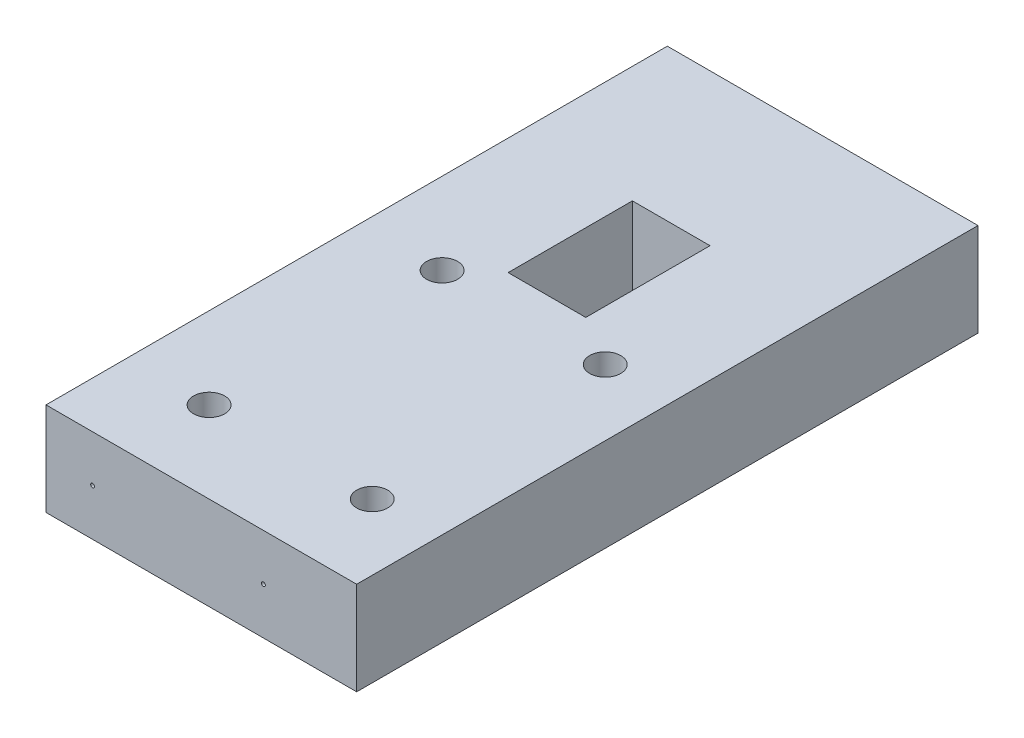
ISO-10303-21;
HEADER;
FILE_DESCRIPTION(('STEP AP214'),'2;1');
FILE_NAME('part.step','',(''),(''),'','','');
FILE_SCHEMA(('AUTOMOTIVE_DESIGN { 1 0 10303 214 1 1 1 1 }'));
ENDSEC;
DATA;
#1=APPLICATION_CONTEXT('core data for automotive mechanical design processes');
#2=APPLICATION_PROTOCOL_DEFINITION('international standard','automotive_design',2000,#1);
#3=PRODUCT_CONTEXT('',#1,'mechanical');
#4=PRODUCT('Part','Part','',(#3));
#5=PRODUCT_RELATED_PRODUCT_CATEGORY('part','',(#4));
#6=PRODUCT_DEFINITION_FORMATION('','',#4);
#7=PRODUCT_DEFINITION_CONTEXT('part definition',#1,'design');
#8=PRODUCT_DEFINITION('design','',#6,#7);
#9=PRODUCT_DEFINITION_SHAPE('','',#8);
#10=(LENGTH_UNIT() NAMED_UNIT(*) SI_UNIT(.MILLI.,.METRE.));
#11=(NAMED_UNIT(*) PLANE_ANGLE_UNIT() SI_UNIT($,.RADIAN.));
#12=(NAMED_UNIT(*) SI_UNIT($,.STERADIAN.) SOLID_ANGLE_UNIT());
#13=UNCERTAINTY_MEASURE_WITH_UNIT(LENGTH_MEASURE(1.E-05),#10,'distance_accuracy_value','');
#14=(GEOMETRIC_REPRESENTATION_CONTEXT(3) GLOBAL_UNCERTAINTY_ASSIGNED_CONTEXT((#13)) GLOBAL_UNIT_ASSIGNED_CONTEXT((#10,
#11,#12)) REPRESENTATION_CONTEXT('',''));
#15=CARTESIAN_POINT('',(0.,0.,0.));
#16=DIRECTION('',(0.,0.,1.));
#17=DIRECTION('',(1.,0.,0.));
#18=AXIS2_PLACEMENT_3D('',#15,#16,#17);
#19=CARTESIAN_POINT('',(0.,38.1,0.));
#20=DIRECTION('',(0.,1.,0.));
#21=DIRECTION('',(0.,0.,1.));
#22=AXIS2_PLACEMENT_3D('',#19,#20,#21);
#23=PLANE('',#22);
#24=CARTESIAN_POINT('',(-30.1625,38.1,-1.58750000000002));
#25=DIRECTION('',(0.,1.,0.));
#26=DIRECTION('',(0.,0.,1.));
#27=AXIS2_PLACEMENT_3D('',#24,#25,#26);
#28=CIRCLE('',#27,6.34999999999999);
#29=CARTESIAN_POINT('',(-30.1625,38.1,4.76249999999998));
#30=VERTEX_POINT('',#29);
#31=EDGE_CURVE('E145',#30,#30,#28,.T.);
#32=ORIENTED_EDGE('',*,*,#31,.F.);
#33=EDGE_LOOP('',(#32));
#34=FACE_BOUND('',#33,.T.);
#35=CARTESIAN_POINT('',(-30.1625,38.1,93.6625));
#36=DIRECTION('',(0.,1.,0.));
#37=DIRECTION('',(0.,0.,1.));
#38=AXIS2_PLACEMENT_3D('',#35,#36,#37);
#39=CIRCLE('',#38,6.34999999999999);
#40=CARTESIAN_POINT('',(-30.1625,38.1,100.0125));
#41=VERTEX_POINT('',#40);
#42=EDGE_CURVE('E151',#41,#41,#39,.T.);
#43=ORIENTED_EDGE('',*,*,#42,.F.);
#44=EDGE_LOOP('',(#43));
#45=FACE_BOUND('',#44,.T.);
#46=CARTESIAN_POINT('',(36.5125,38.1,-1.58750000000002));
#47=DIRECTION('',(0.,1.,0.));
#48=DIRECTION('',(0.,0.,1.));
#49=AXIS2_PLACEMENT_3D('',#46,#47,#48);
#50=CIRCLE('',#49,6.34999999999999);
#51=CARTESIAN_POINT('',(36.5125,38.1,4.76249999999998));
#52=VERTEX_POINT('',#51);
#53=EDGE_CURVE('E157',#52,#52,#50,.T.);
#54=ORIENTED_EDGE('',*,*,#53,.F.);
#55=EDGE_LOOP('',(#54));
#56=FACE_BOUND('',#55,.T.);
#57=CARTESIAN_POINT('',(36.5125,38.1,93.6625));
#58=DIRECTION('',(0.,1.,0.));
#59=DIRECTION('',(0.,0.,1.));
#60=AXIS2_PLACEMENT_3D('',#57,#58,#59);
#61=CIRCLE('',#60,6.34999999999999);
#62=CARTESIAN_POINT('',(36.5125,38.1,100.0125));
#63=VERTEX_POINT('',#62);
#64=EDGE_CURVE('E163',#63,#63,#61,.T.);
#65=ORIENTED_EDGE('',*,*,#64,.F.);
#66=EDGE_LOOP('',(#65));
#67=FACE_BOUND('',#66,.T.);
#68=DIRECTION('',(0.,0.,-1.));
#69=VECTOR('',#68,1.);
#70=CARTESIAN_POINT('',(63.5,38.1,-127.));
#71=LINE('',#70,#69);
#72=CARTESIAN_POINT('',(63.5,38.1,127.));
#73=VERTEX_POINT('',#72);
#74=CARTESIAN_POINT('',(63.5,38.1,-127.));
#75=VERTEX_POINT('',#74);
#76=EDGE_CURVE('E195',#73,#75,#71,.T.);
#77=ORIENTED_EDGE('',*,*,#76,.T.);
#78=DIRECTION('',(-1.,0.,0.));
#79=VECTOR('',#78,1.);
#80=CARTESIAN_POINT('',(-63.5,38.1,-127.));
#81=LINE('',#80,#79);
#82=CARTESIAN_POINT('',(-63.5,38.1,-127.));
#83=VERTEX_POINT('',#82);
#84=EDGE_CURVE('E198',#75,#83,#81,.T.);
#85=ORIENTED_EDGE('',*,*,#84,.T.);
#86=DIRECTION('',(0.,0.,1.));
#87=VECTOR('',#86,1.);
#88=CARTESIAN_POINT('',(-63.5,38.1,-127.));
#89=LINE('',#88,#87);
#90=CARTESIAN_POINT('',(-63.5,38.1,127.));
#91=VERTEX_POINT('',#90);
#92=EDGE_CURVE('E201',#83,#91,#89,.T.);
#93=ORIENTED_EDGE('',*,*,#92,.T.);
#94=DIRECTION('',(1.,0.,0.));
#95=VECTOR('',#94,1.);
#96=CARTESIAN_POINT('',(-63.5,38.1,127.));
#97=LINE('',#96,#95);
#98=EDGE_CURVE('E203',#91,#73,#97,.T.);
#99=ORIENTED_EDGE('',*,*,#98,.T.);
#100=EDGE_LOOP('',(#77,#85,#93,#99));
#101=FACE_BOUND('',#100,.T.);
#102=DIRECTION('',(1.,0.,0.));
#103=VECTOR('',#102,1.);
#104=CARTESIAN_POINT('',(-15.8750000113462,38.1,-14.2874896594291));
#105=LINE('',#104,#103);
#106=CARTESIAN_POINT('',(-15.8750000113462,38.1,-14.2874896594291));
#107=VERTEX_POINT('',#106);
#108=CARTESIAN_POINT('',(15.8749999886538,38.1,-14.2874896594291));
#109=VERTEX_POINT('',#108);
#110=EDGE_CURVE('E171',#107,#109,#105,.T.);
#111=ORIENTED_EDGE('',*,*,#110,.F.);
#112=DIRECTION('',(0.,0.,1.));
#113=VECTOR('',#112,1.);
#114=CARTESIAN_POINT('',(-15.8750000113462,38.1,-65.0874896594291));
#115=LINE('',#114,#113);
#116=CARTESIAN_POINT('',(-15.8750000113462,38.1,-65.0874896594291));
#117=VERTEX_POINT('',#116);
#118=EDGE_CURVE('E169',#117,#107,#115,.T.);
#119=ORIENTED_EDGE('',*,*,#118,.F.);
#120=DIRECTION('',(-1.,0.,0.));
#121=VECTOR('',#120,1.);
#122=CARTESIAN_POINT('',(-15.8750000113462,38.1,-65.0874896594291));
#123=LINE('',#122,#121);
#124=CARTESIAN_POINT('',(15.8749999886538,38.1,-65.0874896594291));
#125=VERTEX_POINT('',#124);
#126=EDGE_CURVE('E176',#125,#117,#123,.T.);
#127=ORIENTED_EDGE('',*,*,#126,.F.);
#128=DIRECTION('',(0.,0.,-1.));
#129=VECTOR('',#128,1.);
#130=CARTESIAN_POINT('',(15.8749999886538,38.1,-65.0874896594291));
#131=LINE('',#130,#129);
#132=EDGE_CURVE('E174',#109,#125,#131,.T.);
#133=ORIENTED_EDGE('',*,*,#132,.F.);
#134=EDGE_LOOP('',(#111,#119,#127,#133));
#135=FACE_BOUND('',#134,.T.);
#136=ADVANCED_FACE('F35',(#34,#45,#56,#67,#101,#135),#23,.T.);
#137=CARTESIAN_POINT('',(0.,0.,0.));
#138=DIRECTION('',(0.,1.,0.));
#139=DIRECTION('',(0.,0.,1.));
#140=AXIS2_PLACEMENT_3D('',#137,#138,#139);
#141=PLANE('',#140);
#142=CARTESIAN_POINT('',(-30.1625,0.,-1.58750000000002));
#143=DIRECTION('',(0.,1.,0.));
#144=DIRECTION('',(0.,0.,1.));
#145=AXIS2_PLACEMENT_3D('',#142,#143,#144);
#146=CIRCLE('',#145,6.34999999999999);
#147=CARTESIAN_POINT('',(-30.1625,0.,4.76249999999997));
#148=VERTEX_POINT('',#147);
#149=EDGE_CURVE('E148',#148,#148,#146,.T.);
#150=ORIENTED_EDGE('',*,*,#149,.T.);
#151=EDGE_LOOP('',(#150));
#152=FACE_BOUND('',#151,.T.);
#153=CARTESIAN_POINT('',(-30.1625,0.,93.6625));
#154=DIRECTION('',(0.,1.,0.));
#155=DIRECTION('',(0.,0.,1.));
#156=AXIS2_PLACEMENT_3D('',#153,#154,#155);
#157=CIRCLE('',#156,6.34999999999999);
#158=CARTESIAN_POINT('',(-30.1625,0.,100.0125));
#159=VERTEX_POINT('',#158);
#160=EDGE_CURVE('E154',#159,#159,#157,.T.);
#161=ORIENTED_EDGE('',*,*,#160,.T.);
#162=EDGE_LOOP('',(#161));
#163=FACE_BOUND('',#162,.T.);
#164=CARTESIAN_POINT('',(36.5125,0.,-1.58750000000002));
#165=DIRECTION('',(0.,1.,0.));
#166=DIRECTION('',(0.,0.,1.));
#167=AXIS2_PLACEMENT_3D('',#164,#165,#166);
#168=CIRCLE('',#167,6.34999999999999);
#169=CARTESIAN_POINT('',(36.5125,0.,4.76249999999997));
#170=VERTEX_POINT('',#169);
#171=EDGE_CURVE('E160',#170,#170,#168,.T.);
#172=ORIENTED_EDGE('',*,*,#171,.T.);
#173=EDGE_LOOP('',(#172));
#174=FACE_BOUND('',#173,.T.);
#175=CARTESIAN_POINT('',(36.5125,0.,93.6625));
#176=DIRECTION('',(0.,1.,0.));
#177=DIRECTION('',(0.,0.,1.));
#178=AXIS2_PLACEMENT_3D('',#175,#176,#177);
#179=CIRCLE('',#178,6.34999999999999);
#180=CARTESIAN_POINT('',(36.5125,0.,100.0125));
#181=VERTEX_POINT('',#180);
#182=EDGE_CURVE('E166',#181,#181,#179,.T.);
#183=ORIENTED_EDGE('',*,*,#182,.T.);
#184=EDGE_LOOP('',(#183));
#185=FACE_BOUND('',#184,.T.);
#186=DIRECTION('',(0.,0.,-1.));
#187=VECTOR('',#186,1.);
#188=CARTESIAN_POINT('',(63.5,0.,-127.));
#189=LINE('',#188,#187);
#190=CARTESIAN_POINT('',(63.5,0.,127.));
#191=VERTEX_POINT('',#190);
#192=CARTESIAN_POINT('',(63.5,0.,-127.));
#193=VERTEX_POINT('',#192);
#194=EDGE_CURVE('E194',#191,#193,#189,.T.);
#195=ORIENTED_EDGE('',*,*,#194,.F.);
#196=DIRECTION('',(1.,0.,0.));
#197=VECTOR('',#196,1.);
#198=CARTESIAN_POINT('',(-63.5,0.,127.));
#199=LINE('',#198,#197);
#200=CARTESIAN_POINT('',(-63.5,0.,127.));
#201=VERTEX_POINT('',#200);
#202=EDGE_CURVE('E199',#201,#191,#199,.T.);
#203=ORIENTED_EDGE('',*,*,#202,.F.);
#204=DIRECTION('',(0.,0.,1.));
#205=VECTOR('',#204,1.);
#206=CARTESIAN_POINT('',(-63.5,0.,-127.));
#207=LINE('',#206,#205);
#208=CARTESIAN_POINT('',(-63.5,0.,-127.));
#209=VERTEX_POINT('',#208);
#210=EDGE_CURVE('E210',#209,#201,#207,.T.);
#211=ORIENTED_EDGE('',*,*,#210,.F.);
#212=DIRECTION('',(-1.,0.,0.));
#213=VECTOR('',#212,1.);
#214=CARTESIAN_POINT('',(-63.5,0.,-127.));
#215=LINE('',#214,#213);
#216=EDGE_CURVE('E208',#193,#209,#215,.T.);
#217=ORIENTED_EDGE('',*,*,#216,.F.);
#218=EDGE_LOOP('',(#195,#203,#211,#217));
#219=FACE_BOUND('',#218,.T.);
#220=DIRECTION('',(0.,0.,1.));
#221=VECTOR('',#220,1.);
#222=CARTESIAN_POINT('',(-15.8750000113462,0.,-65.0874896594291));
#223=LINE('',#222,#221);
#224=CARTESIAN_POINT('',(-15.8750000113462,0.,-65.0874896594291));
#225=VERTEX_POINT('',#224);
#226=CARTESIAN_POINT('',(-15.8750000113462,0.,-14.2874896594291));
#227=VERTEX_POINT('',#226);
#228=EDGE_CURVE('E58',#225,#227,#223,.T.);
#229=ORIENTED_EDGE('',*,*,#228,.T.);
#230=DIRECTION('',(1.,0.,0.));
#231=VECTOR('',#230,1.);
#232=CARTESIAN_POINT('',(-15.8750000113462,0.,-14.2874896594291));
#233=LINE('',#232,#231);
#234=CARTESIAN_POINT('',(15.8749999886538,0.,-14.2874896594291));
#235=VERTEX_POINT('',#234);
#236=EDGE_CURVE('E180',#227,#235,#233,.T.);
#237=ORIENTED_EDGE('',*,*,#236,.T.);
#238=DIRECTION('',(0.,0.,-1.));
#239=VECTOR('',#238,1.);
#240=CARTESIAN_POINT('',(15.8749999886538,0.,-65.0874896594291));
#241=LINE('',#240,#239);
#242=CARTESIAN_POINT('',(15.8749999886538,0.,-65.0874896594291));
#243=VERTEX_POINT('',#242);
#244=EDGE_CURVE('E183',#235,#243,#241,.T.);
#245=ORIENTED_EDGE('',*,*,#244,.T.);
#246=DIRECTION('',(-1.,0.,0.));
#247=VECTOR('',#246,1.);
#248=CARTESIAN_POINT('',(-15.8750000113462,0.,-65.0874896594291));
#249=LINE('',#248,#247);
#250=EDGE_CURVE('E172',#243,#225,#249,.T.);
#251=ORIENTED_EDGE('',*,*,#250,.T.);
#252=EDGE_LOOP('',(#229,#237,#245,#251));
#253=FACE_BOUND('',#252,.T.);
#254=ADVANCED_FACE('F228',(#152,#163,#174,#185,#219,#253),#141,.F.);
#255=CARTESIAN_POINT('',(63.5,38.1,-127.));
#256=DIRECTION('',(-1.,0.,0.));
#257=DIRECTION('',(0.,0.,1.));
#258=AXIS2_PLACEMENT_3D('',#255,#256,#257);
#259=PLANE('',#258);
#260=ORIENTED_EDGE('',*,*,#194,.T.);
#261=DIRECTION('',(0.,-1.,0.));
#262=VECTOR('',#261,1.);
#263=CARTESIAN_POINT('',(63.5,38.1,-127.));
#264=LINE('',#263,#262);
#265=EDGE_CURVE('E11',#75,#193,#264,.T.);
#266=ORIENTED_EDGE('',*,*,#265,.F.);
#267=ORIENTED_EDGE('',*,*,#76,.F.);
#268=DIRECTION('',(0.,-1.,0.));
#269=VECTOR('',#268,1.);
#270=CARTESIAN_POINT('',(63.5,38.1,127.));
#271=LINE('',#270,#269);
#272=EDGE_CURVE('E205',#73,#191,#271,.T.);
#273=ORIENTED_EDGE('',*,*,#272,.T.);
#274=EDGE_LOOP('',(#260,#266,#267,#273));
#275=FACE_BOUND('',#274,.T.);
#276=ADVANCED_FACE('F37',(#275),#259,.F.);
#277=CARTESIAN_POINT('',(-63.5,38.1,-127.));
#278=DIRECTION('',(0.,0.,1.));
#279=DIRECTION('',(1.,0.,0.));
#280=AXIS2_PLACEMENT_3D('',#277,#278,#279);
#281=PLANE('',#280);
#282=CARTESIAN_POINT('',(25.4,19.05,-127.));
#283=DIRECTION('',(0.,0.,-1.));
#284=DIRECTION('',(-1.,0.,0.));
#285=AXIS2_PLACEMENT_3D('',#282,#283,#284);
#286=CIRCLE('',#285,0.793749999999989);
#287=CARTESIAN_POINT('',(24.60625,19.05,-127.));
#288=VERTEX_POINT('',#287);
#289=EDGE_CURVE('E123',#288,#288,#286,.T.);
#290=ORIENTED_EDGE('',*,*,#289,.F.);
#291=EDGE_LOOP('',(#290));
#292=FACE_BOUND('',#291,.T.);
#293=CARTESIAN_POINT('',(-44.45,19.05,-127.));
#294=DIRECTION('',(0.,0.,-1.));
#295=DIRECTION('',(-1.,0.,0.));
#296=AXIS2_PLACEMENT_3D('',#293,#294,#295);
#297=CIRCLE('',#296,0.793749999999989);
#298=CARTESIAN_POINT('',(-45.24375,19.05,-127.));
#299=VERTEX_POINT('',#298);
#300=EDGE_CURVE('E122',#299,#299,#297,.T.);
#301=ORIENTED_EDGE('',*,*,#300,.F.);
#302=EDGE_LOOP('',(#301));
#303=FACE_BOUND('',#302,.T.);
#304=ORIENTED_EDGE('',*,*,#216,.T.);
#305=DIRECTION('',(0.,-1.,0.));
#306=VECTOR('',#305,1.);
#307=CARTESIAN_POINT('',(-63.5,38.1,-127.));
#308=LINE('',#307,#306);
#309=EDGE_CURVE('E43',#83,#209,#308,.T.);
#310=ORIENTED_EDGE('',*,*,#309,.F.);
#311=ORIENTED_EDGE('',*,*,#84,.F.);
#312=ORIENTED_EDGE('',*,*,#265,.T.);
#313=EDGE_LOOP('',(#304,#310,#311,#312));
#314=FACE_BOUND('',#313,.T.);
#315=ADVANCED_FACE('F239',(#292,#303,#314),#281,.F.);
#316=CARTESIAN_POINT('',(-63.5,38.1,-127.));
#317=DIRECTION('',(1.,0.,0.));
#318=DIRECTION('',(0.,0.,-1.));
#319=AXIS2_PLACEMENT_3D('',#316,#317,#318);
#320=PLANE('',#319);
#321=ORIENTED_EDGE('',*,*,#210,.T.);
#322=DIRECTION('',(0.,-1.,0.));
#323=VECTOR('',#322,1.);
#324=CARTESIAN_POINT('',(-63.5,38.1,127.));
#325=LINE('',#324,#323);
#326=EDGE_CURVE('E215',#91,#201,#325,.T.);
#327=ORIENTED_EDGE('',*,*,#326,.F.);
#328=ORIENTED_EDGE('',*,*,#92,.F.);
#329=ORIENTED_EDGE('',*,*,#309,.T.);
#330=EDGE_LOOP('',(#321,#327,#328,#329));
#331=FACE_BOUND('',#330,.T.);
#332=ADVANCED_FACE('F222',(#331),#320,.F.);
#333=CARTESIAN_POINT('',(-63.5,38.1,127.));
#334=DIRECTION('',(0.,0.,-1.));
#335=DIRECTION('',(-1.,0.,0.));
#336=AXIS2_PLACEMENT_3D('',#333,#334,#335);
#337=PLANE('',#336);
#338=CARTESIAN_POINT('',(-44.45,19.05,127.));
#339=DIRECTION('',(0.,0.,1.));
#340=DIRECTION('',(1.,0.,0.));
#341=AXIS2_PLACEMENT_3D('',#338,#339,#340);
#342=CIRCLE('',#341,0.793749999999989);
#343=CARTESIAN_POINT('',(-43.65625,19.05,127.));
#344=VERTEX_POINT('',#343);
#345=EDGE_CURVE('E133',#344,#344,#342,.T.);
#346=ORIENTED_EDGE('',*,*,#345,.F.);
#347=EDGE_LOOP('',(#346));
#348=FACE_BOUND('',#347,.T.);
#349=CARTESIAN_POINT('',(25.4,19.05,127.));
#350=DIRECTION('',(0.,0.,1.));
#351=DIRECTION('',(1.,0.,0.));
#352=AXIS2_PLACEMENT_3D('',#349,#350,#351);
#353=CIRCLE('',#352,0.793749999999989);
#354=CARTESIAN_POINT('',(26.19375,19.05,127.));
#355=VERTEX_POINT('',#354);
#356=EDGE_CURVE('E139',#355,#355,#353,.T.);
#357=ORIENTED_EDGE('',*,*,#356,.F.);
#358=EDGE_LOOP('',(#357));
#359=FACE_BOUND('',#358,.T.);
#360=ORIENTED_EDGE('',*,*,#202,.T.);
#361=ORIENTED_EDGE('',*,*,#272,.F.);
#362=ORIENTED_EDGE('',*,*,#98,.F.);
#363=ORIENTED_EDGE('',*,*,#326,.T.);
#364=EDGE_LOOP('',(#360,#361,#362,#363));
#365=FACE_BOUND('',#364,.T.);
#366=ADVANCED_FACE('F232',(#348,#359,#365),#337,.F.);
#367=CARTESIAN_POINT('',(-15.8750000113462,38.1,-65.0874896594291));
#368=DIRECTION('',(1.,0.,0.));
#369=DIRECTION('',(0.,0.,-1.));
#370=AXIS2_PLACEMENT_3D('',#367,#368,#369);
#371=PLANE('',#370);
#372=ORIENTED_EDGE('',*,*,#228,.F.);
#373=DIRECTION('',(0.,-1.,0.));
#374=VECTOR('',#373,1.);
#375=CARTESIAN_POINT('',(-15.8750000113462,38.1,-65.0874896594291));
#376=LINE('',#375,#374);
#377=EDGE_CURVE('E178',#117,#225,#376,.T.);
#378=ORIENTED_EDGE('',*,*,#377,.F.);
#379=ORIENTED_EDGE('',*,*,#118,.T.);
#380=DIRECTION('',(0.,-1.,0.));
#381=VECTOR('',#380,1.);
#382=CARTESIAN_POINT('',(-15.8750000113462,38.1,-14.2874896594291));
#383=LINE('',#382,#381);
#384=EDGE_CURVE('E192',#107,#227,#383,.T.);
#385=ORIENTED_EDGE('',*,*,#384,.T.);
#386=EDGE_LOOP('',(#372,#378,#379,#385));
#387=FACE_BOUND('',#386,.T.);
#388=ADVANCED_FACE('F260',(#387),#371,.T.);
#389=CARTESIAN_POINT('',(-15.8750000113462,38.1,-14.2874896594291));
#390=DIRECTION('',(0.,0.,-1.));
#391=DIRECTION('',(-1.,0.,0.));
#392=AXIS2_PLACEMENT_3D('',#389,#390,#391);
#393=PLANE('',#392);
#394=ORIENTED_EDGE('',*,*,#236,.F.);
#395=ORIENTED_EDGE('',*,*,#384,.F.);
#396=ORIENTED_EDGE('',*,*,#110,.T.);
#397=DIRECTION('',(0.,-1.,0.));
#398=VECTOR('',#397,1.);
#399=CARTESIAN_POINT('',(15.8749999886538,38.1,-14.2874896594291));
#400=LINE('',#399,#398);
#401=EDGE_CURVE('E190',#109,#235,#400,.T.);
#402=ORIENTED_EDGE('',*,*,#401,.T.);
#403=EDGE_LOOP('',(#394,#395,#396,#402));
#404=FACE_BOUND('',#403,.T.);
#405=ADVANCED_FACE('F268',(#404),#393,.T.);
#406=CARTESIAN_POINT('',(15.8749999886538,38.1,-65.0874896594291));
#407=DIRECTION('',(-1.,0.,0.));
#408=DIRECTION('',(0.,0.,1.));
#409=AXIS2_PLACEMENT_3D('',#406,#407,#408);
#410=PLANE('',#409);
#411=ORIENTED_EDGE('',*,*,#244,.F.);
#412=ORIENTED_EDGE('',*,*,#401,.F.);
#413=ORIENTED_EDGE('',*,*,#132,.T.);
#414=DIRECTION('',(0.,-1.,0.));
#415=VECTOR('',#414,1.);
#416=CARTESIAN_POINT('',(15.8749999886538,38.1,-65.0874896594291));
#417=LINE('',#416,#415);
#418=EDGE_CURVE('E50',#125,#243,#417,.T.);
#419=ORIENTED_EDGE('',*,*,#418,.T.);
#420=EDGE_LOOP('',(#411,#412,#413,#419));
#421=FACE_BOUND('',#420,.T.);
#422=ADVANCED_FACE('F310',(#421),#410,.T.);
#423=CARTESIAN_POINT('',(-15.8750000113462,38.1,-65.0874896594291));
#424=DIRECTION('',(0.,0.,1.));
#425=DIRECTION('',(1.,0.,0.));
#426=AXIS2_PLACEMENT_3D('',#423,#424,#425);
#427=PLANE('',#426);
#428=ORIENTED_EDGE('',*,*,#250,.F.);
#429=ORIENTED_EDGE('',*,*,#418,.F.);
#430=ORIENTED_EDGE('',*,*,#126,.T.);
#431=ORIENTED_EDGE('',*,*,#377,.T.);
#432=EDGE_LOOP('',(#428,#429,#430,#431));
#433=FACE_BOUND('',#432,.T.);
#434=ADVANCED_FACE('F306',(#433),#427,.T.);
#435=CARTESIAN_POINT('',(36.5125,38.1,93.6625));
#436=DIRECTION('',(0.,1.,0.));
#437=DIRECTION('',(0.,0.,1.));
#438=AXIS2_PLACEMENT_3D('',#435,#436,#437);
#439=CYLINDRICAL_SURFACE('',#438,6.34999999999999);
#440=ORIENTED_EDGE('',*,*,#182,.F.);
#441=EDGE_LOOP('',(#440));
#442=FACE_BOUND('',#441,.T.);
#443=ORIENTED_EDGE('',*,*,#64,.T.);
#444=EDGE_LOOP('',(#443));
#445=FACE_BOUND('',#444,.T.);
#446=ADVANCED_FACE('F302',(#442,#445),#439,.F.);
#447=CARTESIAN_POINT('',(36.5125,38.1,-1.58750000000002));
#448=DIRECTION('',(0.,1.,0.));
#449=DIRECTION('',(0.,0.,1.));
#450=AXIS2_PLACEMENT_3D('',#447,#448,#449);
#451=CYLINDRICAL_SURFACE('',#450,6.34999999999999);
#452=ORIENTED_EDGE('',*,*,#171,.F.);
#453=EDGE_LOOP('',(#452));
#454=FACE_BOUND('',#453,.T.);
#455=ORIENTED_EDGE('',*,*,#53,.T.);
#456=EDGE_LOOP('',(#455));
#457=FACE_BOUND('',#456,.T.);
#458=ADVANCED_FACE('F298',(#454,#457),#451,.F.);
#459=CARTESIAN_POINT('',(-30.1625,38.1,93.6625));
#460=DIRECTION('',(0.,1.,0.));
#461=DIRECTION('',(0.,0.,1.));
#462=AXIS2_PLACEMENT_3D('',#459,#460,#461);
#463=CYLINDRICAL_SURFACE('',#462,6.34999999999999);
#464=ORIENTED_EDGE('',*,*,#160,.F.);
#465=EDGE_LOOP('',(#464));
#466=FACE_BOUND('',#465,.T.);
#467=ORIENTED_EDGE('',*,*,#42,.T.);
#468=EDGE_LOOP('',(#467));
#469=FACE_BOUND('',#468,.T.);
#470=ADVANCED_FACE('F294',(#466,#469),#463,.F.);
#471=CARTESIAN_POINT('',(-30.1625,38.1,-1.58750000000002));
#472=DIRECTION('',(0.,1.,0.));
#473=DIRECTION('',(0.,0.,1.));
#474=AXIS2_PLACEMENT_3D('',#471,#472,#473);
#475=CYLINDRICAL_SURFACE('',#474,6.34999999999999);
#476=ORIENTED_EDGE('',*,*,#149,.F.);
#477=EDGE_LOOP('',(#476));
#478=FACE_BOUND('',#477,.T.);
#479=ORIENTED_EDGE('',*,*,#31,.T.);
#480=EDGE_LOOP('',(#479));
#481=FACE_BOUND('',#480,.T.);
#482=ADVANCED_FACE('F286',(#478,#481),#475,.F.);
#483=CARTESIAN_POINT('',(25.4,19.05,88.9));
#484=DIRECTION('',(0.,0.,1.));
#485=DIRECTION('',(1.,0.,0.));
#486=AXIS2_PLACEMENT_3D('',#483,#484,#485);
#487=CONICAL_SURFACE('',#486,0.793749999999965,1.02974425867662);
#488=CARTESIAN_POINT('',(25.4,19.05,88.4230668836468));
#489=VERTEX_POINT('',#488);
#490=VERTEX_LOOP('',#489);
#491=FACE_BOUND('',#490,.T.);
#492=CARTESIAN_POINT('',(25.4,19.05,88.9));
#493=DIRECTION('',(0.,0.,1.));
#494=DIRECTION('',(1.,0.,0.));
#495=AXIS2_PLACEMENT_3D('',#492,#493,#494);
#496=CIRCLE('',#495,0.793749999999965);
#497=CARTESIAN_POINT('',(26.19375,19.05,88.9));
#498=VERTEX_POINT('',#497);
#499=EDGE_CURVE('E142',#498,#498,#496,.T.);
#500=ORIENTED_EDGE('',*,*,#499,.T.);
#501=EDGE_LOOP('',(#500));
#502=FACE_BOUND('',#501,.T.);
#503=ADVANCED_FACE('F276',(#491,#502),#487,.F.);
#504=CARTESIAN_POINT('',(25.4,19.05,127.));
#505=DIRECTION('',(0.,0.,1.));
#506=DIRECTION('',(1.,0.,0.));
#507=AXIS2_PLACEMENT_3D('',#504,#505,#506);
#508=CYLINDRICAL_SURFACE('',#507,0.793749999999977);
#509=ORIENTED_EDGE('',*,*,#499,.F.);
#510=EDGE_LOOP('',(#509));
#511=FACE_BOUND('',#510,.T.);
#512=ORIENTED_EDGE('',*,*,#356,.T.);
#513=EDGE_LOOP('',(#512));
#514=FACE_BOUND('',#513,.T.);
#515=ADVANCED_FACE('F273',(#511,#514),#508,.F.);
#516=CARTESIAN_POINT('',(-44.45,19.05,88.9));
#517=DIRECTION('',(0.,0.,1.));
#518=DIRECTION('',(1.,0.,0.));
#519=AXIS2_PLACEMENT_3D('',#516,#517,#518);
#520=CONICAL_SURFACE('',#519,0.793749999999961,1.02974425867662);
#521=CARTESIAN_POINT('',(-44.45,19.05,88.4230668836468));
#522=VERTEX_POINT('',#521);
#523=VERTEX_LOOP('',#522);
#524=FACE_BOUND('',#523,.T.);
#525=CARTESIAN_POINT('',(-44.45,19.05,88.9));
#526=DIRECTION('',(0.,0.,1.));
#527=DIRECTION('',(1.,0.,0.));
#528=AXIS2_PLACEMENT_3D('',#525,#526,#527);
#529=CIRCLE('',#528,0.793749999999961);
#530=CARTESIAN_POINT('',(-43.65625,19.05,88.9));
#531=VERTEX_POINT('',#530);
#532=EDGE_CURVE('E136',#531,#531,#529,.T.);
#533=ORIENTED_EDGE('',*,*,#532,.T.);
#534=EDGE_LOOP('',(#533));
#535=FACE_BOUND('',#534,.T.);
#536=ADVANCED_FACE('F275',(#524,#535),#520,.F.);
#537=CARTESIAN_POINT('',(-44.45,19.05,127.));
#538=DIRECTION('',(0.,0.,1.));
#539=DIRECTION('',(1.,0.,0.));
#540=AXIS2_PLACEMENT_3D('',#537,#538,#539);
#541=CYLINDRICAL_SURFACE('',#540,0.793749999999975);
#542=ORIENTED_EDGE('',*,*,#532,.F.);
#543=EDGE_LOOP('',(#542));
#544=FACE_BOUND('',#543,.T.);
#545=ORIENTED_EDGE('',*,*,#345,.T.);
#546=EDGE_LOOP('',(#545));
#547=FACE_BOUND('',#546,.T.);
#548=ADVANCED_FACE('F283',(#544,#547),#541,.F.);
#549=CARTESIAN_POINT('',(-44.45,19.05,-88.9));
#550=DIRECTION('',(0.,0.,-1.));
#551=DIRECTION('',(-1.,0.,0.));
#552=AXIS2_PLACEMENT_3D('',#549,#550,#551);
#553=CONICAL_SURFACE('',#552,0.793749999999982,1.02974425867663);
#554=CARTESIAN_POINT('',(-44.45,19.05,-88.4230668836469));
#555=VERTEX_POINT('',#554);
#556=VERTEX_LOOP('',#555);
#557=FACE_BOUND('',#556,.T.);
#558=CARTESIAN_POINT('',(-44.45,19.05,-88.9));
#559=DIRECTION('',(0.,0.,-1.));
#560=DIRECTION('',(-1.,0.,0.));
#561=AXIS2_PLACEMENT_3D('',#558,#559,#560);
#562=CIRCLE('',#561,0.793749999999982);
#563=CARTESIAN_POINT('',(-45.24375,19.05,-88.9));
#564=VERTEX_POINT('',#563);
#565=EDGE_CURVE('E126',#564,#564,#562,.T.);
#566=ORIENTED_EDGE('',*,*,#565,.T.);
#567=EDGE_LOOP('',(#566));
#568=FACE_BOUND('',#567,.T.);
#569=ADVANCED_FACE('F377',(#557,#568),#553,.F.);
#570=CARTESIAN_POINT('',(-44.45,19.05,-127.));
#571=DIRECTION('',(0.,0.,-1.));
#572=DIRECTION('',(-1.,0.,0.));
#573=AXIS2_PLACEMENT_3D('',#570,#571,#572);
#574=CYLINDRICAL_SURFACE('',#573,0.793749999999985);
#575=ORIENTED_EDGE('',*,*,#565,.F.);
#576=EDGE_LOOP('',(#575));
#577=FACE_BOUND('',#576,.T.);
#578=ORIENTED_EDGE('',*,*,#300,.T.);
#579=EDGE_LOOP('',(#578));
#580=FACE_BOUND('',#579,.T.);
#581=ADVANCED_FACE('F116',(#577,#580),#574,.F.);
#582=CARTESIAN_POINT('',(25.4,19.05,-88.9));
#583=DIRECTION('',(0.,0.,-1.));
#584=DIRECTION('',(-1.,0.,0.));
#585=AXIS2_PLACEMENT_3D('',#582,#583,#584);
#586=CONICAL_SURFACE('',#585,0.793749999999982,1.02974425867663);
#587=CARTESIAN_POINT('',(25.4,19.05,-88.4230668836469));
#588=VERTEX_POINT('',#587);
#589=VERTEX_LOOP('',#588);
#590=FACE_BOUND('',#589,.T.);
#591=CARTESIAN_POINT('',(25.4,19.05,-88.9));
#592=DIRECTION('',(0.,0.,-1.));
#593=DIRECTION('',(-1.,0.,0.));
#594=AXIS2_PLACEMENT_3D('',#591,#592,#593);
#595=CIRCLE('',#594,0.793749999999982);
#596=CARTESIAN_POINT('',(24.60625,19.05,-88.9));
#597=VERTEX_POINT('',#596);
#598=EDGE_CURVE('E120',#597,#597,#595,.T.);
#599=ORIENTED_EDGE('',*,*,#598,.T.);
#600=EDGE_LOOP('',(#599));
#601=FACE_BOUND('',#600,.T.);
#602=ADVANCED_FACE('F112',(#590,#601),#586,.F.);
#603=CARTESIAN_POINT('',(25.4,19.05,-127.));
#604=DIRECTION('',(0.,0.,-1.));
#605=DIRECTION('',(-1.,0.,0.));
#606=AXIS2_PLACEMENT_3D('',#603,#604,#605);
#607=CYLINDRICAL_SURFACE('',#606,0.793749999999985);
#608=ORIENTED_EDGE('',*,*,#598,.F.);
#609=EDGE_LOOP('',(#608));
#610=FACE_BOUND('',#609,.T.);
#611=ORIENTED_EDGE('',*,*,#289,.T.);
#612=EDGE_LOOP('',(#611));
#613=FACE_BOUND('',#612,.T.);
#614=ADVANCED_FACE('F115',(#610,#613),#607,.F.);
#615=CLOSED_SHELL('',(#136,#254,#276,#315,#332,#366,#388,#405,#422,#434,#446,#458,#470,#482,
#503,#515,#536,#548,#569,#581,#602,#614));
#616=MANIFOLD_SOLID_BREP('B2',#615);
#617=ADVANCED_BREP_SHAPE_REPRESENTATION('',(#18,#616),#14);
#618=SHAPE_DEFINITION_REPRESENTATION(#9,#617);
ENDSEC;
END-ISO-10303-21;
